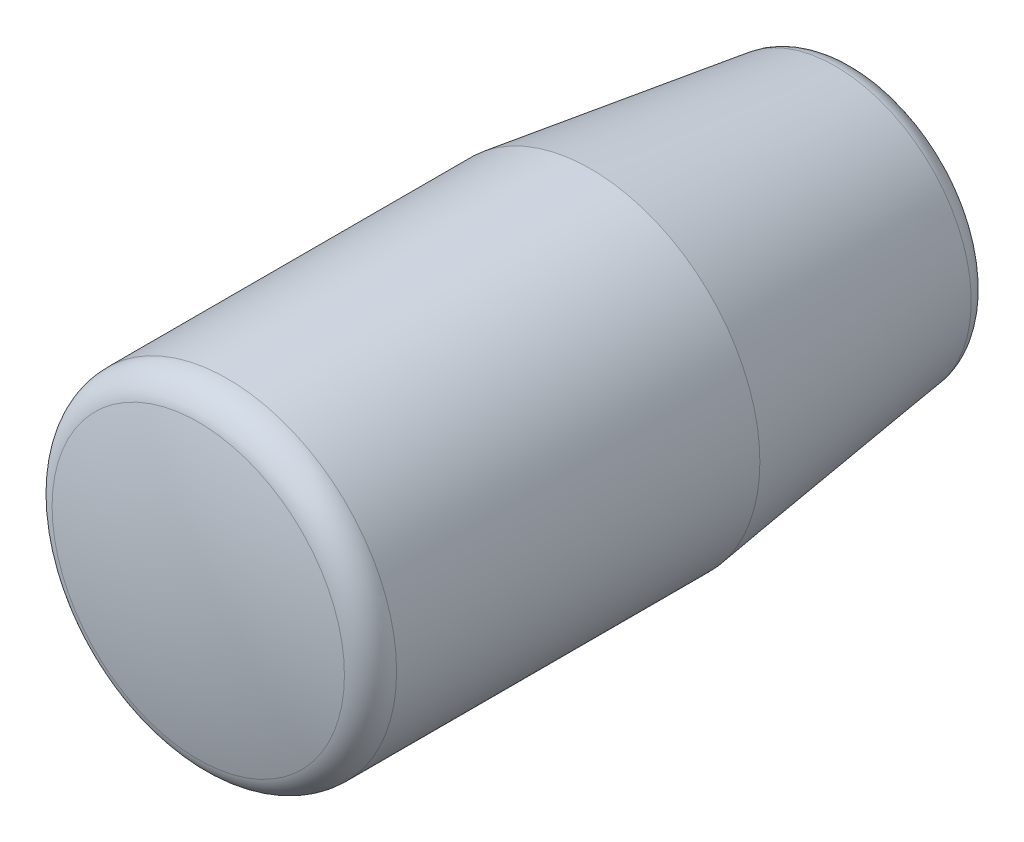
ISO-10303-21;
HEADER;
FILE_DESCRIPTION(('STEP AP214'),'2;1');
FILE_NAME('part.step','',(''),(''),'','','');
FILE_SCHEMA(('AUTOMOTIVE_DESIGN { 1 0 10303 214 1 1 1 1 }'));
ENDSEC;
DATA;
#1=APPLICATION_CONTEXT('core data for automotive mechanical design processes');
#2=APPLICATION_PROTOCOL_DEFINITION('international standard','automotive_design',2000,#1);
#3=PRODUCT_CONTEXT('',#1,'mechanical');
#4=PRODUCT('Part','Part','',(#3));
#5=PRODUCT_RELATED_PRODUCT_CATEGORY('part','',(#4));
#6=PRODUCT_DEFINITION_FORMATION('','',#4);
#7=PRODUCT_DEFINITION_CONTEXT('part definition',#1,'design');
#8=PRODUCT_DEFINITION('design','',#6,#7);
#9=PRODUCT_DEFINITION_SHAPE('','',#8);
#10=(LENGTH_UNIT() NAMED_UNIT(*) SI_UNIT(.MILLI.,.METRE.));
#11=(NAMED_UNIT(*) PLANE_ANGLE_UNIT() SI_UNIT($,.RADIAN.));
#12=(NAMED_UNIT(*) SI_UNIT($,.STERADIAN.) SOLID_ANGLE_UNIT());
#13=UNCERTAINTY_MEASURE_WITH_UNIT(LENGTH_MEASURE(1.E-05),#10,'distance_accuracy_value','');
#14=(GEOMETRIC_REPRESENTATION_CONTEXT(3) GLOBAL_UNCERTAINTY_ASSIGNED_CONTEXT((#13)) GLOBAL_UNIT_ASSIGNED_CONTEXT((#10,
#11,#12)) REPRESENTATION_CONTEXT('',''));
#15=CARTESIAN_POINT('',(0.,0.,0.));
#16=DIRECTION('',(0.,0.,1.));
#17=DIRECTION('',(1.,0.,0.));
#18=AXIS2_PLACEMENT_3D('',#15,#16,#17);
#19=CARTESIAN_POINT('',(0.,0.,0.));
#20=DIRECTION('',(0.,0.,1.));
#21=DIRECTION('',(1.,0.,0.));
#22=AXIS2_PLACEMENT_3D('',#19,#20,#21);
#23=CONICAL_SURFACE('',#22,2.75,1.57078947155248);
#24=CARTESIAN_POINT('',(0.,0.,1.28681104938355E-05));
#25=DIRECTION('',(0.,0.,-1.));
#26=DIRECTION('',(-1.,0.,0.));
#27=AXIS2_PLACEMENT_3D('',#24,#25,#26);
#28=CIRCLE('',#27,4.62711968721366);
#29=CARTESIAN_POINT('',(-4.62711968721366,0.,1.28681104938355E-05));
#30=VERTEX_POINT('',#29);
#31=EDGE_CURVE('E58',#30,#30,#28,.T.);
#32=ORIENTED_EDGE('',*,*,#31,.T.);
#33=EDGE_LOOP('',(#32));
#34=FACE_BOUND('',#33,.T.);
#35=CARTESIAN_POINT('',(0.,0.,0.));
#36=DIRECTION('',(0.,0.,-1.));
#37=DIRECTION('',(-1.,0.,0.));
#38=AXIS2_PLACEMENT_3D('',#35,#36,#37);
#39=CIRCLE('',#38,2.75);
#40=CARTESIAN_POINT('',(-2.75,0.,0.));
#41=VERTEX_POINT('',#40);
#42=EDGE_CURVE('E9',#41,#41,#39,.T.);
#43=ORIENTED_EDGE('',*,*,#42,.F.);
#44=EDGE_LOOP('',(#43));
#45=FACE_BOUND('',#44,.T.);
#46=ADVANCED_FACE('F14',(#34,#45),#23,.T.);
#47=CARTESIAN_POINT('',(0.,0.,-2.50001567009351));
#48=DIRECTION('',(0.,0.,-1.));
#49=DIRECTION('',(-1.,0.,0.));
#50=AXIS2_PLACEMENT_3D('',#47,#48,#49);
#51=CYLINDRICAL_SURFACE('',#50,2.75);
#52=CARTESIAN_POINT('',(0.,0.,1.5000000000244));
#53=DIRECTION('',(0.,0.,-1.));
#54=DIRECTION('',(-1.,0.,0.));
#55=AXIS2_PLACEMENT_3D('',#52,#53,#54);
#56=CIRCLE('',#55,2.75);
#57=CARTESIAN_POINT('',(-2.75,0.,1.5000000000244));
#58=VERTEX_POINT('',#57);
#59=EDGE_CURVE('E21',#58,#58,#56,.T.);
#60=ORIENTED_EDGE('',*,*,#59,.F.);
#61=EDGE_LOOP('',(#60));
#62=FACE_BOUND('',#61,.T.);
#63=ORIENTED_EDGE('',*,*,#42,.T.);
#64=EDGE_LOOP('',(#63));
#65=FACE_BOUND('',#64,.T.);
#66=ADVANCED_FACE('F47',(#62,#65),#51,.F.);
#67=CARTESIAN_POINT('',(0.,0.,1.4999843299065));
#68=DIRECTION('',(0.,0.,1.));
#69=DIRECTION('',(1.,0.,0.));
#70=AXIS2_PLACEMENT_3D('',#67,#68,#69);
#71=CONICAL_SURFACE('',#70,2.5,1.57073364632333);
#72=ORIENTED_EDGE('',*,*,#59,.T.);
#73=EDGE_LOOP('',(#72));
#74=FACE_BOUND('',#73,.T.);
#75=CARTESIAN_POINT('',(0.,0.,1.4999843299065));
#76=DIRECTION('',(0.,0.,-1.));
#77=DIRECTION('',(-1.,0.,0.));
#78=AXIS2_PLACEMENT_3D('',#75,#76,#77);
#79=CIRCLE('',#78,2.5);
#80=CARTESIAN_POINT('',(-2.5,0.,1.4999843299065));
#81=VERTEX_POINT('',#80);
#82=EDGE_CURVE('E79',#81,#81,#79,.T.);
#83=ORIENTED_EDGE('',*,*,#82,.F.);
#84=EDGE_LOOP('',(#83));
#85=FACE_BOUND('',#84,.T.);
#86=ADVANCED_FACE('F53',(#74,#85),#71,.T.);
#87=CARTESIAN_POINT('',(0.,0.,-2.50001567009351));
#88=DIRECTION('',(0.,0.,-1.));
#89=DIRECTION('',(-1.,0.,0.));
#90=AXIS2_PLACEMENT_3D('',#87,#88,#89);
#91=CYLINDRICAL_SURFACE('',#90,2.5);
#92=CARTESIAN_POINT('',(0.,0.,11.9999985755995));
#93=DIRECTION('',(0.,0.,-1.));
#94=DIRECTION('',(-1.,0.,0.));
#95=AXIS2_PLACEMENT_3D('',#92,#93,#94);
#96=CIRCLE('',#95,2.5);
#97=CARTESIAN_POINT('',(-2.5,0.,11.9999985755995));
#98=VERTEX_POINT('',#97);
#99=EDGE_CURVE('E76',#98,#98,#96,.T.);
#100=ORIENTED_EDGE('',*,*,#99,.F.);
#101=EDGE_LOOP('',(#100));
#102=FACE_BOUND('',#101,.T.);
#103=ORIENTED_EDGE('',*,*,#82,.T.);
#104=EDGE_LOOP('',(#103));
#105=FACE_BOUND('',#104,.T.);
#106=ADVANCED_FACE('F42',(#102,#105),#91,.F.);
#107=CARTESIAN_POINT('',(0.,0.,11.9999815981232));
#108=DIRECTION('',(0.,0.,1.));
#109=DIRECTION('',(1.,0.,0.));
#110=AXIS2_PLACEMENT_3D('',#107,#108,#109);
#111=CONICAL_SURFACE('',#110,0.,1.57078953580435);
#112=ORIENTED_EDGE('',*,*,#99,.T.);
#113=EDGE_LOOP('',(#112));
#114=FACE_BOUND('',#113,.T.);
#115=CARTESIAN_POINT('',(0.,0.,11.9999815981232));
#116=VERTEX_POINT('',#115);
#117=VERTEX_LOOP('',#116);
#118=FACE_BOUND('',#117,.T.);
#119=ADVANCED_FACE('F30',(#114,#118),#111,.T.);
#120=CARTESIAN_POINT('',(-0.000169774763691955,0.,2.9999815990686));
#121=DIRECTION('',(0.,-1.,0.));
#122=DIRECTION('',(-1.,0.,0.));
#123=AXIS2_PLACEMENT_3D('',#120,#121,#122);
#124=CIRCLE('',#123,25.0000013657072);
#125=TRIMMED_CURVE('',#124,(PARAMETER_VALUE(-1.57080311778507)),
(PARAMETER_VALUE(1.57080311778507)),.T.,.PARAMETER.);
#126=CARTESIAN_POINT('',(0.,0.,2.9999815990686));
#127=DIRECTION('',(0.,0.,-1.));
#128=AXIS1_PLACEMENT('',#126,#127);
#129=SURFACE_OF_REVOLUTION('',#125,#128);
#130=CARTESIAN_POINT('',(0.,0.,27.2562737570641));
#131=DIRECTION('',(0.,0.,-1.));
#132=DIRECTION('',(-1.,0.,0.));
#133=AXIS2_PLACEMENT_3D('',#130,#131,#132);
#134=CIRCLE('',#133,6.05263696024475);
#135=CARTESIAN_POINT('',(-6.05263696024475,0.,27.2562737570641));
#136=VERTEX_POINT('',#135);
#137=EDGE_CURVE('E73',#136,#136,#134,.T.);
#138=ORIENTED_EDGE('',*,*,#137,.F.);
#139=EDGE_LOOP('',(#138));
#140=FACE_BOUND('',#139,.T.);
#141=CARTESIAN_POINT('',(0.,0.,27.9999843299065));
#142=VERTEX_POINT('',#141);
#143=VERTEX_LOOP('',#142);
#144=FACE_BOUND('',#143,.T.);
#145=ADVANCED_FACE('F27',(#140,#144),#129,.T.);
#146=CARTESIAN_POINT('',(0.,0.,26.0434612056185));
#147=DIRECTION('',(0.,0.,-1.));
#148=DIRECTION('',(-1.,0.,0.));
#149=AXIS2_PLACEMENT_3D('',#146,#147,#148);
#150=TOROIDAL_SURFACE('',#149,5.75000000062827,1.25000000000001);
#151=CARTESIAN_POINT('',(0.,0.,26.0434215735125));
#152=DIRECTION('',(0.,0.,-1.));
#153=DIRECTION('',(-1.,0.,0.));
#154=AXIS2_PLACEMENT_3D('',#151,#152,#153);
#155=CIRCLE('',#154,7.);
#156=CARTESIAN_POINT('',(-7.,0.,26.0434215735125));
#157=VERTEX_POINT('',#156);
#158=EDGE_CURVE('E70',#157,#157,#155,.T.);
#159=ORIENTED_EDGE('',*,*,#158,.F.);
#160=EDGE_LOOP('',(#159));
#161=FACE_BOUND('',#160,.T.);
#162=ORIENTED_EDGE('',*,*,#137,.T.);
#163=EDGE_LOOP('',(#162));
#164=FACE_BOUND('',#163,.T.);
#165=ADVANCED_FACE('F29',(#161,#164),#150,.T.);
#166=CARTESIAN_POINT('',(0.,0.,-2.50001567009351));
#167=DIRECTION('',(0.,0.,-1.));
#168=DIRECTION('',(-1.,0.,0.));
#169=AXIS2_PLACEMENT_3D('',#166,#167,#168);
#170=CYLINDRICAL_SURFACE('',#169,7.);
#171=ORIENTED_EDGE('',*,*,#158,.T.);
#172=EDGE_LOOP('',(#171));
#173=FACE_BOUND('',#172,.T.);
#174=CARTESIAN_POINT('',(0.,0.,10.9999843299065));
#175=DIRECTION('',(0.,0.,-1.));
#176=DIRECTION('',(-1.,0.,0.));
#177=AXIS2_PLACEMENT_3D('',#174,#175,#176);
#178=CIRCLE('',#177,7.);
#179=CARTESIAN_POINT('',(-7.,0.,10.9999843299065));
#180=VERTEX_POINT('',#179);
#181=EDGE_CURVE('E65',#180,#180,#178,.T.);
#182=ORIENTED_EDGE('',*,*,#181,.F.);
#183=EDGE_LOOP('',(#182));
#184=FACE_BOUND('',#183,.T.);
#185=ADVANCED_FACE('F39',(#173,#184),#170,.T.);
#186=CARTESIAN_POINT('',(0.,0.,0.864899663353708));
#187=DIRECTION('',(0.,0.,1.));
#188=DIRECTION('',(1.,0.,0.));
#189=AXIS2_PLACEMENT_3D('',#186,#187,#188);
#190=CONICAL_SURFACE('',#189,5.61794300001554,0.135527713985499);
#191=ORIENTED_EDGE('',*,*,#181,.T.);
#192=EDGE_LOOP('',(#191));
#193=FACE_BOUND('',#192,.T.);
#194=CARTESIAN_POINT('',(0.,0.,0.864899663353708));
#195=DIRECTION('',(0.,0.,-1.));
#196=DIRECTION('',(-1.,0.,0.));
#197=AXIS2_PLACEMENT_3D('',#194,#195,#196);
#198=CIRCLE('',#197,5.61794300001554);
#199=CARTESIAN_POINT('',(-5.61794300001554,0.,0.864899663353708));
#200=VERTEX_POINT('',#199);
#201=EDGE_CURVE('E62',#200,#200,#198,.T.);
#202=ORIENTED_EDGE('',*,*,#201,.F.);
#203=EDGE_LOOP('',(#202));
#204=FACE_BOUND('',#203,.T.);
#205=ADVANCED_FACE('F142',(#193,#204),#190,.T.);
#206=CARTESIAN_POINT('',(0.,0.,1.000012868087));
#207=DIRECTION('',(0.,0.,-1.));
#208=DIRECTION('',(-1.,0.,0.));
#209=AXIS2_PLACEMENT_3D('',#206,#207,#208);
#210=TOROIDAL_SURFACE('',#209,4.62711283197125,1.);
#211=ORIENTED_EDGE('',*,*,#31,.F.);
#212=EDGE_LOOP('',(#211));
#213=FACE_BOUND('',#212,.T.);
#214=ORIENTED_EDGE('',*,*,#201,.T.);
#215=EDGE_LOOP('',(#214));
#216=FACE_BOUND('',#215,.T.);
#217=ADVANCED_FACE('F150',(#213,#216),#210,.T.);
#218=CLOSED_SHELL('',(#46,#66,#86,#106,#119,#145,#165,#185,#205,#217));
#219=MANIFOLD_SOLID_BREP('B1',#218);
#220=ADVANCED_BREP_SHAPE_REPRESENTATION('',(#18,#219),#14);
#221=SHAPE_DEFINITION_REPRESENTATION(#9,#220);
ENDSEC;
END-ISO-10303-21;
